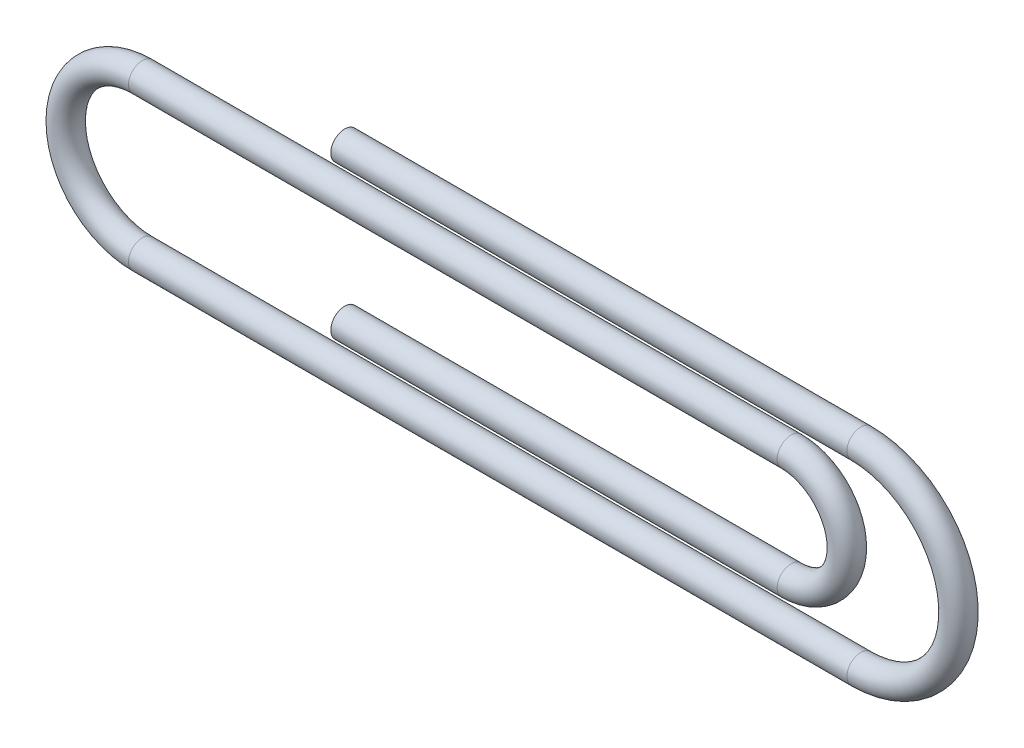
ISO-10303-21;
HEADER;
FILE_DESCRIPTION(('STEP AP214'),'2;1');
FILE_NAME('part.step','',(''),(''),'','','');
FILE_SCHEMA(('AUTOMOTIVE_DESIGN { 1 0 10303 214 1 1 1 1 }'));
ENDSEC;
DATA;
#1=APPLICATION_CONTEXT('core data for automotive mechanical design processes');
#2=APPLICATION_PROTOCOL_DEFINITION('international standard','automotive_design',2000,#1);
#3=PRODUCT_CONTEXT('',#1,'mechanical');
#4=PRODUCT('Part','Part','',(#3));
#5=PRODUCT_RELATED_PRODUCT_CATEGORY('part','',(#4));
#6=PRODUCT_DEFINITION_FORMATION('','',#4);
#7=PRODUCT_DEFINITION_CONTEXT('part definition',#1,'design');
#8=PRODUCT_DEFINITION('design','',#6,#7);
#9=PRODUCT_DEFINITION_SHAPE('','',#8);
#10=(LENGTH_UNIT() NAMED_UNIT(*) SI_UNIT(.MILLI.,.METRE.));
#11=(NAMED_UNIT(*) PLANE_ANGLE_UNIT() SI_UNIT($,.RADIAN.));
#12=(NAMED_UNIT(*) SI_UNIT($,.STERADIAN.) SOLID_ANGLE_UNIT());
#13=UNCERTAINTY_MEASURE_WITH_UNIT(LENGTH_MEASURE(1.E-05),#10,'distance_accuracy_value','');
#14=(GEOMETRIC_REPRESENTATION_CONTEXT(3) GLOBAL_UNCERTAINTY_ASSIGNED_CONTEXT((#13)) GLOBAL_UNIT_ASSIGNED_CONTEXT((#10,
#11,#12)) REPRESENTATION_CONTEXT('',''));
#15=CARTESIAN_POINT('',(0.,0.,0.));
#16=DIRECTION('',(0.,0.,1.));
#17=DIRECTION('',(1.,0.,0.));
#18=AXIS2_PLACEMENT_3D('',#15,#16,#17);
#19=CARTESIAN_POINT('',(16.,-5.5,0.));
#20=DIRECTION('',(-1.,0.,0.));
#21=DIRECTION('',(0.,-1.,0.));
#22=AXIS2_PLACEMENT_3D('',#19,#20,#21);
#23=CYLINDRICAL_SURFACE('',#22,0.5);
#24=CARTESIAN_POINT('',(16.,-5.5,0.));
#25=DIRECTION('',(-1.,0.,0.));
#26=DIRECTION('',(0.,0.,-1.));
#27=AXIS2_PLACEMENT_3D('',#24,#25,#26);
#28=CIRCLE('',#27,0.5);
#29=CARTESIAN_POINT('',(16.,-6.,0.));
#30=VERTEX_POINT('',#29);
#31=EDGE_CURVE('E36',#30,#30,#28,.T.);
#32=ORIENTED_EDGE('',*,*,#31,.T.);
#33=EDGE_LOOP('',(#32));
#34=FACE_BOUND('',#33,.T.);
#35=CARTESIAN_POINT('',(0.,-5.5,0.));
#36=DIRECTION('',(-1.,0.,0.));
#37=DIRECTION('',(0.,0.,-1.));
#38=AXIS2_PLACEMENT_3D('',#35,#36,#37);
#39=CIRCLE('',#38,0.5);
#40=CARTESIAN_POINT('',(0.,-5.5,-0.5));
#41=VERTEX_POINT('',#40);
#42=EDGE_CURVE('E10',#41,#41,#39,.T.);
#43=ORIENTED_EDGE('',*,*,#42,.F.);
#44=EDGE_LOOP('',(#43));
#45=FACE_BOUND('',#44,.T.);
#46=ADVANCED_FACE('F30',(#34,#45),#23,.T.);
#47=CARTESIAN_POINT('',(16.,-3.5,0.));
#48=DIRECTION('',(0.,0.,-1.));
#49=DIRECTION('',(-1.,0.,0.));
#50=AXIS2_PLACEMENT_3D('',#47,#48,#49);
#51=TOROIDAL_SURFACE('',#50,2.,0.5);
#52=CARTESIAN_POINT('',(16.,-1.5,0.));
#53=DIRECTION('',(1.,0.,0.));
#54=DIRECTION('',(0.,0.,-1.));
#55=AXIS2_PLACEMENT_3D('',#52,#53,#54);
#56=CIRCLE('',#55,0.5);
#57=CARTESIAN_POINT('',(16.,-0.999999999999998,0.));
#58=VERTEX_POINT('',#57);
#59=EDGE_CURVE('E40',#58,#58,#56,.T.);
#60=CARTESIAN_POINT('',(16.,-3.5,0.));
#61=DIRECTION('',(0.,0.,-1.));
#62=DIRECTION('',(-1.,0.,0.));
#63=AXIS2_PLACEMENT_3D('',#60,#61,#62);
#64=CIRCLE('',#63,2.5);
#65=EDGE_CURVE('',#58,#30,#64,.T.);
#66=ORIENTED_EDGE('',*,*,#59,.T.);
#67=ORIENTED_EDGE('',*,*,#31,.F.);
#68=ORIENTED_EDGE('',*,*,#65,.T.);
#69=ORIENTED_EDGE('',*,*,#65,.F.);
#70=EDGE_LOOP('',(#66,#68,#67,#69));
#71=FACE_BOUND('',#70,.T.);
#72=ADVANCED_FACE('F80',(#71),#51,.T.);
#73=CARTESIAN_POINT('',(-7.25,-1.5,0.));
#74=DIRECTION('',(1.,0.,0.));
#75=DIRECTION('',(0.,1.,0.));
#76=AXIS2_PLACEMENT_3D('',#73,#74,#75);
#77=CYLINDRICAL_SURFACE('',#76,0.5);
#78=CARTESIAN_POINT('',(-7.25,-1.5,0.));
#79=DIRECTION('',(1.,0.,0.));
#80=DIRECTION('',(0.,0.,-1.));
#81=AXIS2_PLACEMENT_3D('',#78,#79,#80);
#82=CIRCLE('',#81,0.5);
#83=CARTESIAN_POINT('',(-7.25,-1.,0.));
#84=VERTEX_POINT('',#83);
#85=EDGE_CURVE('E44',#84,#84,#82,.T.);
#86=ORIENTED_EDGE('',*,*,#85,.T.);
#87=EDGE_LOOP('',(#86));
#88=FACE_BOUND('',#87,.T.);
#89=ORIENTED_EDGE('',*,*,#59,.F.);
#90=EDGE_LOOP('',(#89));
#91=FACE_BOUND('',#90,.T.);
#92=ADVANCED_FACE('F84',(#88,#91),#77,.T.);
#93=CARTESIAN_POINT('',(-7.25,-4.25,0.));
#94=DIRECTION('',(0.,0.,-1.));
#95=DIRECTION('',(-1.,0.,0.));
#96=AXIS2_PLACEMENT_3D('',#93,#94,#95);
#97=TOROIDAL_SURFACE('',#96,2.75,0.5);
#98=CARTESIAN_POINT('',(-7.25,-7.,0.));
#99=DIRECTION('',(-1.,0.,0.));
#100=DIRECTION('',(0.,0.,-1.));
#101=AXIS2_PLACEMENT_3D('',#98,#99,#100);
#102=CIRCLE('',#101,0.5);
#103=CARTESIAN_POINT('',(-7.25,-7.5,0.));
#104=VERTEX_POINT('',#103);
#105=EDGE_CURVE('E49',#104,#104,#102,.T.);
#106=CARTESIAN_POINT('',(-7.25,-4.25,0.));
#107=DIRECTION('',(0.,0.,-1.));
#108=DIRECTION('',(-1.,0.,0.));
#109=AXIS2_PLACEMENT_3D('',#106,#107,#108);
#110=CIRCLE('',#109,3.25);
#111=EDGE_CURVE('',#104,#84,#110,.T.);
#112=ORIENTED_EDGE('',*,*,#105,.T.);
#113=ORIENTED_EDGE('',*,*,#85,.F.);
#114=ORIENTED_EDGE('',*,*,#111,.T.);
#115=ORIENTED_EDGE('',*,*,#111,.F.);
#116=EDGE_LOOP('',(#112,#114,#113,#115));
#117=FACE_BOUND('',#116,.T.);
#118=ADVANCED_FACE('F90',(#117),#97,.T.);
#119=CARTESIAN_POINT('',(18.5,-7.,0.));
#120=DIRECTION('',(-1.,0.,0.));
#121=DIRECTION('',(0.,0.,1.));
#122=AXIS2_PLACEMENT_3D('',#119,#120,#121);
#123=CYLINDRICAL_SURFACE('',#122,0.5);
#124=CARTESIAN_POINT('',(18.5,-7.,0.));
#125=DIRECTION('',(-1.,0.,0.));
#126=DIRECTION('',(0.,0.,-1.));
#127=AXIS2_PLACEMENT_3D('',#124,#125,#126);
#128=CIRCLE('',#127,0.5);
#129=CARTESIAN_POINT('',(18.5,-7.5,0.));
#130=VERTEX_POINT('',#129);
#131=EDGE_CURVE('E52',#130,#130,#128,.T.);
#132=ORIENTED_EDGE('',*,*,#131,.T.);
#133=EDGE_LOOP('',(#132));
#134=FACE_BOUND('',#133,.T.);
#135=ORIENTED_EDGE('',*,*,#105,.F.);
#136=EDGE_LOOP('',(#135));
#137=FACE_BOUND('',#136,.T.);
#138=ADVANCED_FACE('F97',(#134,#137),#123,.T.);
#139=CARTESIAN_POINT('',(18.5,-3.5,0.));
#140=DIRECTION('',(0.,0.,-1.));
#141=DIRECTION('',(-1.,0.,0.));
#142=AXIS2_PLACEMENT_3D('',#139,#140,#141);
#143=TOROIDAL_SURFACE('',#142,3.5,0.5);
#144=CARTESIAN_POINT('',(18.5,0.,0.));
#145=DIRECTION('',(1.,0.,0.));
#146=DIRECTION('',(0.,0.,-1.));
#147=AXIS2_PLACEMENT_3D('',#144,#145,#146);
#148=CIRCLE('',#147,0.5);
#149=CARTESIAN_POINT('',(18.5,0.5,0.));
#150=VERTEX_POINT('',#149);
#151=EDGE_CURVE('E55',#150,#150,#148,.T.);
#152=CARTESIAN_POINT('',(18.5,-3.5,0.));
#153=DIRECTION('',(0.,0.,-1.));
#154=DIRECTION('',(-1.,0.,0.));
#155=AXIS2_PLACEMENT_3D('',#152,#153,#154);
#156=CIRCLE('',#155,4.);
#157=EDGE_CURVE('',#150,#130,#156,.T.);
#158=ORIENTED_EDGE('',*,*,#151,.T.);
#159=ORIENTED_EDGE('',*,*,#131,.F.);
#160=ORIENTED_EDGE('',*,*,#157,.T.);
#161=ORIENTED_EDGE('',*,*,#157,.F.);
#162=EDGE_LOOP('',(#158,#160,#159,#161));
#163=FACE_BOUND('',#162,.T.);
#164=ADVANCED_FACE('F62',(#163),#143,.T.);
#165=CARTESIAN_POINT('',(18.5,0.,0.));
#166=DIRECTION('',(-1.,0.,0.));
#167=DIRECTION('',(0.,0.,1.));
#168=AXIS2_PLACEMENT_3D('',#165,#166,#167);
#169=CYLINDRICAL_SURFACE('',#168,0.5);
#170=ORIENTED_EDGE('',*,*,#151,.F.);
#171=EDGE_LOOP('',(#170));
#172=FACE_BOUND('',#171,.T.);
#173=CARTESIAN_POINT('',(0.,0.,0.));
#174=DIRECTION('',(1.,0.,0.));
#175=DIRECTION('',(0.,0.,-1.));
#176=AXIS2_PLACEMENT_3D('',#173,#174,#175);
#177=CIRCLE('',#176,0.5);
#178=CARTESIAN_POINT('',(0.,0.,-0.5));
#179=VERTEX_POINT('',#178);
#180=EDGE_CURVE('E56',#179,#179,#177,.T.);
#181=ORIENTED_EDGE('',*,*,#180,.T.);
#182=EDGE_LOOP('',(#181));
#183=FACE_BOUND('',#182,.T.);
#184=ADVANCED_FACE('F65',(#172,#183),#169,.T.);
#185=CARTESIAN_POINT('',(0.,-5.5,0.));
#186=DIRECTION('',(-1.,0.,0.));
#187=DIRECTION('',(0.,0.,-1.));
#188=AXIS2_PLACEMENT_3D('',#185,#186,#187);
#189=PLANE('',#188);
#190=ORIENTED_EDGE('',*,*,#42,.T.);
#191=EDGE_LOOP('',(#190));
#192=FACE_BOUND('',#191,.T.);
#193=ADVANCED_FACE('F68',(#192),#189,.T.);
#194=CARTESIAN_POINT('',(0.,0.,0.));
#195=DIRECTION('',(1.,0.,0.));
#196=DIRECTION('',(0.,0.,-1.));
#197=AXIS2_PLACEMENT_3D('',#194,#195,#196);
#198=PLANE('',#197);
#199=ORIENTED_EDGE('',*,*,#180,.F.);
#200=EDGE_LOOP('',(#199));
#201=FACE_BOUND('',#200,.T.);
#202=ADVANCED_FACE('F72',(#201),#198,.F.);
#203=CLOSED_SHELL('',(#46,#72,#92,#118,#138,#164,#184,#193,#202));
#204=MANIFOLD_SOLID_BREP('B2',#203);
#205=ADVANCED_BREP_SHAPE_REPRESENTATION('',(#18,#204),#14);
#206=SHAPE_DEFINITION_REPRESENTATION(#9,#205);
ENDSEC;
END-ISO-10303-21;
